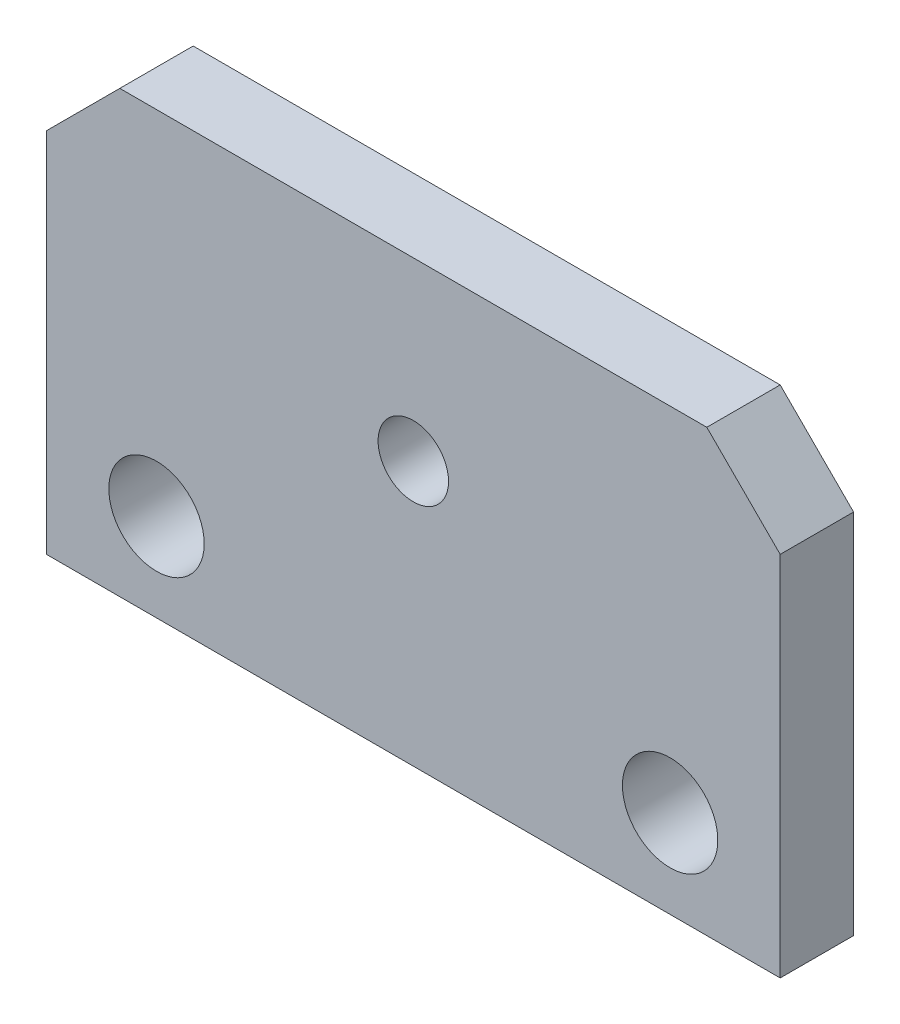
ISO-10303-21;
HEADER;
FILE_DESCRIPTION(('STEP AP214'),'2;1');
FILE_NAME('part.step','',(''),(''),'','','');
FILE_SCHEMA(('AUTOMOTIVE_DESIGN { 1 0 10303 214 1 1 1 1 }'));
ENDSEC;
DATA;
#1=APPLICATION_CONTEXT('core data for automotive mechanical design processes');
#2=APPLICATION_PROTOCOL_DEFINITION('international standard','automotive_design',2000,#1);
#3=PRODUCT_CONTEXT('',#1,'mechanical');
#4=PRODUCT('Part','Part','',(#3));
#5=PRODUCT_RELATED_PRODUCT_CATEGORY('part','',(#4));
#6=PRODUCT_DEFINITION_FORMATION('','',#4);
#7=PRODUCT_DEFINITION_CONTEXT('part definition',#1,'design');
#8=PRODUCT_DEFINITION('design','',#6,#7);
#9=PRODUCT_DEFINITION_SHAPE('','',#8);
#10=(LENGTH_UNIT() NAMED_UNIT(*) SI_UNIT(.MILLI.,.METRE.));
#11=(NAMED_UNIT(*) PLANE_ANGLE_UNIT() SI_UNIT($,.RADIAN.));
#12=(NAMED_UNIT(*) SI_UNIT($,.STERADIAN.) SOLID_ANGLE_UNIT());
#13=UNCERTAINTY_MEASURE_WITH_UNIT(LENGTH_MEASURE(1.E-05),#10,'distance_accuracy_value','');
#14=(GEOMETRIC_REPRESENTATION_CONTEXT(3) GLOBAL_UNCERTAINTY_ASSIGNED_CONTEXT((#13)) GLOBAL_UNIT_ASSIGNED_CONTEXT((#10,
#11,#12)) REPRESENTATION_CONTEXT('',''));
#15=CARTESIAN_POINT('',(0.,0.,0.));
#16=DIRECTION('',(0.,0.,1.));
#17=DIRECTION('',(1.,0.,0.));
#18=AXIS2_PLACEMENT_3D('',#15,#16,#17);
#19=CARTESIAN_POINT('',(-25.,0.,5.));
#20=DIRECTION('',(1.,0.,0.));
#21=DIRECTION('',(0.,0.,-1.));
#22=AXIS2_PLACEMENT_3D('',#19,#20,#21);
#23=PLANE('',#22);
#24=DIRECTION('',(0.,-1.,0.));
#25=VECTOR('',#24,1.);
#26=CARTESIAN_POINT('',(-25.,0.,5.));
#27=LINE('',#26,#25);
#28=CARTESIAN_POINT('',(-25.,25.,5.));
#29=VERTEX_POINT('',#28);
#30=CARTESIAN_POINT('',(-25.,0.,5.));
#31=VERTEX_POINT('',#30);
#32=EDGE_CURVE('E133',#29,#31,#27,.T.);
#33=ORIENTED_EDGE('',*,*,#32,.F.);
#34=DIRECTION('',(0.,0.,-1.));
#35=VECTOR('',#34,1.);
#36=CARTESIAN_POINT('',(-25.,25.,5.));
#37=LINE('',#36,#35);
#38=CARTESIAN_POINT('',(-25.,25.,0.));
#39=VERTEX_POINT('',#38);
#40=EDGE_CURVE('E11',#29,#39,#37,.T.);
#41=ORIENTED_EDGE('',*,*,#40,.T.);
#42=DIRECTION('',(0.,-1.,0.));
#43=VECTOR('',#42,1.);
#44=CARTESIAN_POINT('',(-25.,0.,0.));
#45=LINE('',#44,#43);
#46=CARTESIAN_POINT('',(-25.,0.,0.));
#47=VERTEX_POINT('',#46);
#48=EDGE_CURVE('E83',#39,#47,#45,.T.);
#49=ORIENTED_EDGE('',*,*,#48,.T.);
#50=DIRECTION('',(0.,0.,-1.));
#51=VECTOR('',#50,1.);
#52=CARTESIAN_POINT('',(-25.,0.,5.));
#53=LINE('',#52,#51);
#54=EDGE_CURVE('E86',#31,#47,#53,.T.);
#55=ORIENTED_EDGE('',*,*,#54,.F.);
#56=EDGE_LOOP('',(#33,#41,#49,#55));
#57=FACE_BOUND('',#56,.T.);
#58=ADVANCED_FACE('F28',(#57),#23,.F.);
#59=CARTESIAN_POINT('',(-25.,0.,5.));
#60=DIRECTION('',(0.,1.,0.));
#61=DIRECTION('',(0.,0.,1.));
#62=AXIS2_PLACEMENT_3D('',#59,#60,#61);
#63=PLANE('',#62);
#64=DIRECTION('',(1.,0.,0.));
#65=VECTOR('',#64,1.);
#66=CARTESIAN_POINT('',(-25.,0.,0.));
#67=LINE('',#66,#65);
#68=CARTESIAN_POINT('',(25.,0.,0.));
#69=VERTEX_POINT('',#68);
#70=EDGE_CURVE('E89',#47,#69,#67,.T.);
#71=ORIENTED_EDGE('',*,*,#70,.T.);
#72=DIRECTION('',(0.,0.,-1.));
#73=VECTOR('',#72,1.);
#74=CARTESIAN_POINT('',(25.,0.,5.));
#75=LINE('',#74,#73);
#76=CARTESIAN_POINT('',(25.,0.,5.));
#77=VERTEX_POINT('',#76);
#78=EDGE_CURVE('E104',#77,#69,#75,.T.);
#79=ORIENTED_EDGE('',*,*,#78,.F.);
#80=DIRECTION('',(1.,0.,0.));
#81=VECTOR('',#80,1.);
#82=CARTESIAN_POINT('',(-25.,0.,5.));
#83=LINE('',#82,#81);
#84=EDGE_CURVE('E102',#31,#77,#83,.T.);
#85=ORIENTED_EDGE('',*,*,#84,.F.);
#86=ORIENTED_EDGE('',*,*,#54,.T.);
#87=EDGE_LOOP('',(#71,#79,#85,#86));
#88=FACE_BOUND('',#87,.T.);
#89=ADVANCED_FACE('F101',(#88),#63,.F.);
#90=CARTESIAN_POINT('',(25.,0.,5.));
#91=DIRECTION('',(-1.,0.,0.));
#92=DIRECTION('',(0.,0.,1.));
#93=AXIS2_PLACEMENT_3D('',#90,#91,#92);
#94=PLANE('',#93);
#95=DIRECTION('',(0.,1.,0.));
#96=VECTOR('',#95,1.);
#97=CARTESIAN_POINT('',(25.,0.,0.));
#98=LINE('',#97,#96);
#99=CARTESIAN_POINT('',(25.,25.,0.));
#100=VERTEX_POINT('',#99);
#101=EDGE_CURVE('E95',#69,#100,#98,.T.);
#102=ORIENTED_EDGE('',*,*,#101,.T.);
#103=DIRECTION('',(0.,0.,1.));
#104=VECTOR('',#103,1.);
#105=CARTESIAN_POINT('',(25.,25.,5.));
#106=LINE('',#105,#104);
#107=CARTESIAN_POINT('',(25.,25.,5.));
#108=VERTEX_POINT('',#107);
#109=EDGE_CURVE('E50',#100,#108,#106,.T.);
#110=ORIENTED_EDGE('',*,*,#109,.T.);
#111=DIRECTION('',(0.,1.,0.));
#112=VECTOR('',#111,1.);
#113=CARTESIAN_POINT('',(25.,0.,5.));
#114=LINE('',#113,#112);
#115=EDGE_CURVE('E122',#77,#108,#114,.T.);
#116=ORIENTED_EDGE('',*,*,#115,.F.);
#117=ORIENTED_EDGE('',*,*,#78,.T.);
#118=EDGE_LOOP('',(#102,#110,#116,#117));
#119=FACE_BOUND('',#118,.T.);
#120=ADVANCED_FACE('F131',(#119),#94,.F.);
#121=CARTESIAN_POINT('',(-25.,30.,5.));
#122=DIRECTION('',(0.,-1.,0.));
#123=DIRECTION('',(0.,0.,-1.));
#124=AXIS2_PLACEMENT_3D('',#121,#122,#123);
#125=PLANE('',#124);
#126=DIRECTION('',(-1.,0.,0.));
#127=VECTOR('',#126,1.);
#128=CARTESIAN_POINT('',(-25.,30.,5.));
#129=LINE('',#128,#127);
#130=CARTESIAN_POINT('',(20.,30.,5.));
#131=VERTEX_POINT('',#130);
#132=CARTESIAN_POINT('',(-20.,30.,5.));
#133=VERTEX_POINT('',#132);
#134=EDGE_CURVE('E108',#131,#133,#129,.T.);
#135=ORIENTED_EDGE('',*,*,#134,.F.);
#136=DIRECTION('',(0.,0.,-1.));
#137=VECTOR('',#136,1.);
#138=CARTESIAN_POINT('',(20.,30.,5.));
#139=LINE('',#138,#137);
#140=CARTESIAN_POINT('',(20.,30.,0.));
#141=VERTEX_POINT('',#140);
#142=EDGE_CURVE('E106',#131,#141,#139,.T.);
#143=ORIENTED_EDGE('',*,*,#142,.T.);
#144=DIRECTION('',(-1.,0.,0.));
#145=VECTOR('',#144,1.);
#146=CARTESIAN_POINT('',(-25.,30.,0.));
#147=LINE('',#146,#145);
#148=CARTESIAN_POINT('',(-20.,30.,0.));
#149=VERTEX_POINT('',#148);
#150=EDGE_CURVE('E130',#141,#149,#147,.T.);
#151=ORIENTED_EDGE('',*,*,#150,.T.);
#152=DIRECTION('',(0.,0.,1.));
#153=VECTOR('',#152,1.);
#154=CARTESIAN_POINT('',(-20.,30.,5.));
#155=LINE('',#154,#153);
#156=EDGE_CURVE('E103',#149,#133,#155,.T.);
#157=ORIENTED_EDGE('',*,*,#156,.T.);
#158=EDGE_LOOP('',(#135,#143,#151,#157));
#159=FACE_BOUND('',#158,.T.);
#160=ADVANCED_FACE('F126',(#159),#125,.F.);
#161=CARTESIAN_POINT('',(-25.,30.,5.));
#162=DIRECTION('',(0.,0.,-1.));
#163=DIRECTION('',(-1.,0.,0.));
#164=AXIS2_PLACEMENT_3D('',#161,#162,#163);
#165=PLANE('',#164);
#166=CARTESIAN_POINT('',(0.,18.,5.));
#167=DIRECTION('',(0.,0.,1.));
#168=DIRECTION('',(1.,0.,0.));
#169=AXIS2_PLACEMENT_3D('',#166,#167,#168);
#170=CIRCLE('',#169,2.39999999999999);
#171=CARTESIAN_POINT('',(2.39999999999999,18.,5.));
#172=VERTEX_POINT('',#171);
#173=EDGE_CURVE('E189',#172,#172,#170,.T.);
#174=ORIENTED_EDGE('',*,*,#173,.F.);
#175=EDGE_LOOP('',(#174));
#176=FACE_BOUND('',#175,.T.);
#177=CARTESIAN_POINT('',(17.5,6.,5.));
#178=DIRECTION('',(0.,0.,1.));
#179=DIRECTION('',(-1.,0.,0.));
#180=AXIS2_PLACEMENT_3D('',#177,#178,#179);
#181=CIRCLE('',#180,3.25);
#182=CARTESIAN_POINT('',(14.25,6.,5.));
#183=VERTEX_POINT('',#182);
#184=EDGE_CURVE('E185',#183,#183,#181,.T.);
#185=ORIENTED_EDGE('',*,*,#184,.F.);
#186=EDGE_LOOP('',(#185));
#187=FACE_BOUND('',#186,.T.);
#188=CARTESIAN_POINT('',(-17.5,6.,5.));
#189=DIRECTION('',(0.,0.,1.));
#190=DIRECTION('',(1.,0.,0.));
#191=AXIS2_PLACEMENT_3D('',#188,#189,#190);
#192=CIRCLE('',#191,3.25);
#193=CARTESIAN_POINT('',(-14.25,6.,5.));
#194=VERTEX_POINT('',#193);
#195=EDGE_CURVE('E179',#194,#194,#192,.T.);
#196=ORIENTED_EDGE('',*,*,#195,.F.);
#197=EDGE_LOOP('',(#196));
#198=FACE_BOUND('',#197,.T.);
#199=ORIENTED_EDGE('',*,*,#115,.T.);
#200=DIRECTION('',(0.707106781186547,-0.707106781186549,0.));
#201=VECTOR('',#200,1.);
#202=CARTESIAN_POINT('',(20.,30.,5.));
#203=LINE('',#202,#201);
#204=EDGE_CURVE('E35',#108,#131,#203,.F.);
#205=ORIENTED_EDGE('',*,*,#204,.T.);
#206=ORIENTED_EDGE('',*,*,#134,.T.);
#207=DIRECTION('',(0.707106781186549,0.707106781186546,0.));
#208=VECTOR('',#207,1.);
#209=CARTESIAN_POINT('',(-25.,25.,5.));
#210=LINE('',#209,#208);
#211=EDGE_CURVE('E42',#133,#29,#210,.F.);
#212=ORIENTED_EDGE('',*,*,#211,.T.);
#213=ORIENTED_EDGE('',*,*,#32,.T.);
#214=ORIENTED_EDGE('',*,*,#84,.T.);
#215=EDGE_LOOP('',(#199,#205,#206,#212,#213,#214));
#216=FACE_BOUND('',#215,.T.);
#217=ADVANCED_FACE('F121',(#176,#187,#198,#216),#165,.F.);
#218=CARTESIAN_POINT('',(-25.,30.,0.));
#219=DIRECTION('',(0.,0.,-1.));
#220=DIRECTION('',(-1.,0.,0.));
#221=AXIS2_PLACEMENT_3D('',#218,#219,#220);
#222=PLANE('',#221);
#223=CARTESIAN_POINT('',(0.,18.,0.));
#224=DIRECTION('',(0.,0.,1.));
#225=DIRECTION('',(1.,0.,0.));
#226=AXIS2_PLACEMENT_3D('',#223,#224,#225);
#227=CIRCLE('',#226,2.4);
#228=CARTESIAN_POINT('',(2.4,18.,0.));
#229=VERTEX_POINT('',#228);
#230=EDGE_CURVE('E172',#229,#229,#227,.T.);
#231=ORIENTED_EDGE('',*,*,#230,.T.);
#232=EDGE_LOOP('',(#231));
#233=FACE_BOUND('',#232,.T.);
#234=CARTESIAN_POINT('',(17.5,6.,0.));
#235=DIRECTION('',(0.,0.,1.));
#236=DIRECTION('',(-1.,0.,0.));
#237=AXIS2_PLACEMENT_3D('',#234,#235,#236);
#238=CIRCLE('',#237,3.25);
#239=CARTESIAN_POINT('',(14.25,6.,0.));
#240=VERTEX_POINT('',#239);
#241=EDGE_CURVE('E176',#240,#240,#238,.T.);
#242=ORIENTED_EDGE('',*,*,#241,.T.);
#243=EDGE_LOOP('',(#242));
#244=FACE_BOUND('',#243,.T.);
#245=CARTESIAN_POINT('',(-17.5,6.,0.));
#246=DIRECTION('',(0.,0.,1.));
#247=DIRECTION('',(1.,0.,0.));
#248=AXIS2_PLACEMENT_3D('',#245,#246,#247);
#249=CIRCLE('',#248,3.25);
#250=CARTESIAN_POINT('',(-14.25,6.,0.));
#251=VERTEX_POINT('',#250);
#252=EDGE_CURVE('E90',#251,#251,#249,.T.);
#253=ORIENTED_EDGE('',*,*,#252,.T.);
#254=EDGE_LOOP('',(#253));
#255=FACE_BOUND('',#254,.T.);
#256=ORIENTED_EDGE('',*,*,#150,.F.);
#257=DIRECTION('',(-0.707106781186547,0.707106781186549,0.));
#258=VECTOR('',#257,1.);
#259=CARTESIAN_POINT('',(-2.49999999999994,52.5,0.));
#260=LINE('',#259,#258);
#261=EDGE_CURVE('E116',#141,#100,#260,.F.);
#262=ORIENTED_EDGE('',*,*,#261,.T.);
#263=ORIENTED_EDGE('',*,*,#101,.F.);
#264=ORIENTED_EDGE('',*,*,#70,.F.);
#265=ORIENTED_EDGE('',*,*,#48,.F.);
#266=DIRECTION('',(-0.707106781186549,-0.707106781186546,0.));
#267=VECTOR('',#266,1.);
#268=CARTESIAN_POINT('',(-22.5,27.5,0.));
#269=LINE('',#268,#267);
#270=EDGE_CURVE('E114',#39,#149,#269,.F.);
#271=ORIENTED_EDGE('',*,*,#270,.T.);
#272=EDGE_LOOP('',(#256,#262,#263,#264,#265,#271));
#273=FACE_BOUND('',#272,.T.);
#274=ADVANCED_FACE('F94',(#233,#244,#255,#273),#222,.T.);
#275=CARTESIAN_POINT('',(20.,30.,5.));
#276=DIRECTION('',(-0.707106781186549,-0.707106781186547,0.));
#277=DIRECTION('',(0.707106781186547,-0.707106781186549,0.));
#278=AXIS2_PLACEMENT_3D('',#275,#276,#277);
#279=PLANE('',#278);
#280=ORIENTED_EDGE('',*,*,#204,.F.);
#281=ORIENTED_EDGE('',*,*,#109,.F.);
#282=ORIENTED_EDGE('',*,*,#261,.F.);
#283=ORIENTED_EDGE('',*,*,#142,.F.);
#284=EDGE_LOOP('',(#280,#281,#282,#283));
#285=FACE_BOUND('',#284,.T.);
#286=ADVANCED_FACE('F129',(#285),#279,.F.);
#287=CARTESIAN_POINT('',(-25.,25.,5.));
#288=DIRECTION('',(0.707106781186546,-0.707106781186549,0.));
#289=DIRECTION('',(0.707106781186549,0.707106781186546,0.));
#290=AXIS2_PLACEMENT_3D('',#287,#288,#289);
#291=PLANE('',#290);
#292=ORIENTED_EDGE('',*,*,#211,.F.);
#293=ORIENTED_EDGE('',*,*,#156,.F.);
#294=ORIENTED_EDGE('',*,*,#270,.F.);
#295=ORIENTED_EDGE('',*,*,#40,.F.);
#296=EDGE_LOOP('',(#292,#293,#294,#295));
#297=FACE_BOUND('',#296,.T.);
#298=ADVANCED_FACE('F139',(#297),#291,.F.);
#299=CARTESIAN_POINT('',(-17.5,6.,0.));
#300=DIRECTION('',(0.,0.,1.));
#301=DIRECTION('',(1.,0.,0.));
#302=AXIS2_PLACEMENT_3D('',#299,#300,#301);
#303=CYLINDRICAL_SURFACE('',#302,3.25);
#304=ORIENTED_EDGE('',*,*,#252,.F.);
#305=EDGE_LOOP('',(#304));
#306=FACE_BOUND('',#305,.T.);
#307=ORIENTED_EDGE('',*,*,#195,.T.);
#308=EDGE_LOOP('',(#307));
#309=FACE_BOUND('',#308,.T.);
#310=ADVANCED_FACE('F141',(#306,#309),#303,.F.);
#311=CARTESIAN_POINT('',(17.5,6.,0.));
#312=DIRECTION('',(0.,0.,1.));
#313=DIRECTION('',(1.,0.,0.));
#314=AXIS2_PLACEMENT_3D('',#311,#312,#313);
#315=CYLINDRICAL_SURFACE('',#314,3.25);
#316=ORIENTED_EDGE('',*,*,#241,.F.);
#317=EDGE_LOOP('',(#316));
#318=FACE_BOUND('',#317,.T.);
#319=ORIENTED_EDGE('',*,*,#184,.T.);
#320=EDGE_LOOP('',(#319));
#321=FACE_BOUND('',#320,.T.);
#322=ADVANCED_FACE('F147',(#318,#321),#315,.F.);
#323=CARTESIAN_POINT('',(0.,18.,5.));
#324=DIRECTION('',(0.,0.,1.));
#325=DIRECTION('',(1.,0.,0.));
#326=AXIS2_PLACEMENT_3D('',#323,#324,#325);
#327=CYLINDRICAL_SURFACE('',#326,2.39999999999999);
#328=ORIENTED_EDGE('',*,*,#230,.F.);
#329=EDGE_LOOP('',(#328));
#330=FACE_BOUND('',#329,.T.);
#331=ORIENTED_EDGE('',*,*,#173,.T.);
#332=EDGE_LOOP('',(#331));
#333=FACE_BOUND('',#332,.T.);
#334=ADVANCED_FACE('F193',(#330,#333),#327,.F.);
#335=CLOSED_SHELL('',(#58,#89,#120,#160,#217,#274,#286,#298,#310,#322,#334));
#336=MANIFOLD_SOLID_BREP('B2',#335);
#337=ADVANCED_BREP_SHAPE_REPRESENTATION('',(#18,#336),#14);
#338=SHAPE_DEFINITION_REPRESENTATION(#9,#337);
ENDSEC;
END-ISO-10303-21;
